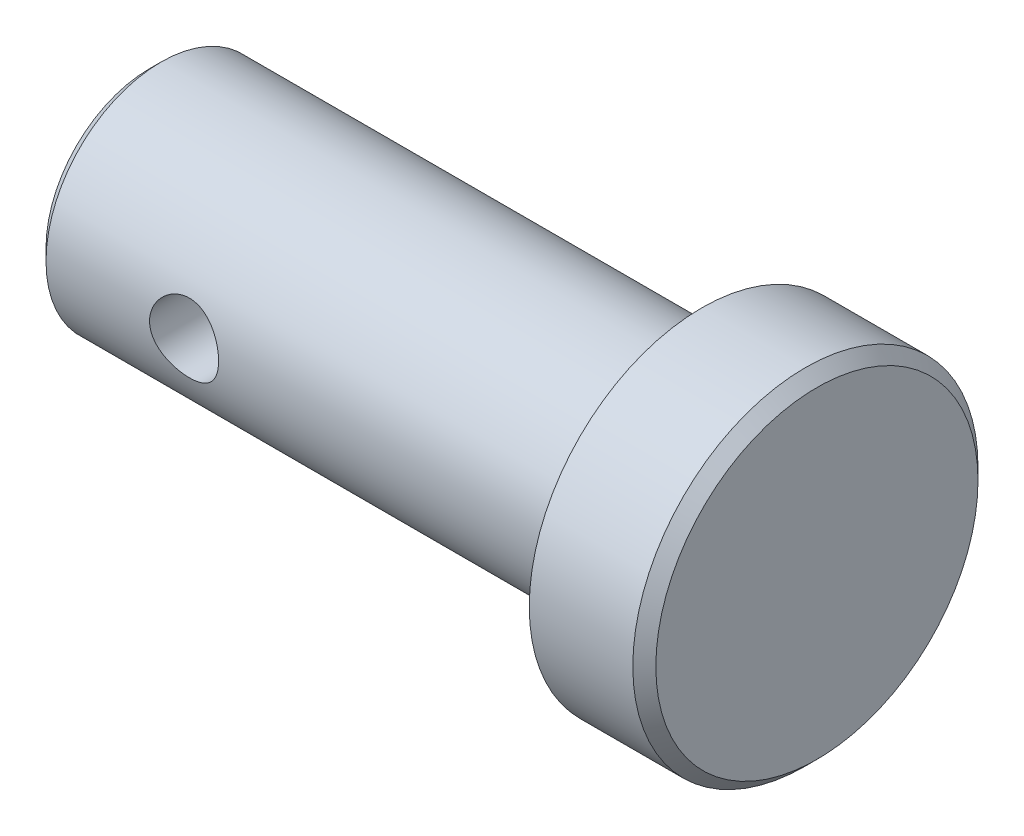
ISO-10303-21;
HEADER;
FILE_DESCRIPTION(('STEP AP214'),'2;1');
FILE_NAME('part.step','',(''),(''),'','','');
FILE_SCHEMA(('AUTOMOTIVE_DESIGN { 1 0 10303 214 1 1 1 1 }'));
ENDSEC;
DATA;
#1=APPLICATION_CONTEXT('core data for automotive mechanical design processes');
#2=APPLICATION_PROTOCOL_DEFINITION('international standard','automotive_design',2000,#1);
#3=PRODUCT_CONTEXT('',#1,'mechanical');
#4=PRODUCT('Part','Part','',(#3));
#5=PRODUCT_RELATED_PRODUCT_CATEGORY('part','',(#4));
#6=PRODUCT_DEFINITION_FORMATION('','',#4);
#7=PRODUCT_DEFINITION_CONTEXT('part definition',#1,'design');
#8=PRODUCT_DEFINITION('design','',#6,#7);
#9=PRODUCT_DEFINITION_SHAPE('','',#8);
#10=(LENGTH_UNIT() NAMED_UNIT(*) SI_UNIT(.MILLI.,.METRE.));
#11=(NAMED_UNIT(*) PLANE_ANGLE_UNIT() SI_UNIT($,.RADIAN.));
#12=(NAMED_UNIT(*) SI_UNIT($,.STERADIAN.) SOLID_ANGLE_UNIT());
#13=UNCERTAINTY_MEASURE_WITH_UNIT(LENGTH_MEASURE(1.E-05),#10,'distance_accuracy_value','');
#14=(GEOMETRIC_REPRESENTATION_CONTEXT(3) GLOBAL_UNCERTAINTY_ASSIGNED_CONTEXT((#13)) GLOBAL_UNIT_ASSIGNED_CONTEXT((#10,
#11,#12)) REPRESENTATION_CONTEXT('',''));
#15=CARTESIAN_POINT('',(0.,0.,0.));
#16=DIRECTION('',(0.,0.,1.));
#17=DIRECTION('',(1.,0.,0.));
#18=AXIS2_PLACEMENT_3D('',#15,#16,#17);
#19=CARTESIAN_POINT('',(12.,0.,0.));
#20=DIRECTION('',(-1.,0.,0.));
#21=DIRECTION('',(0.,0.,1.));
#22=AXIS2_PLACEMENT_3D('',#19,#20,#21);
#23=CYLINDRICAL_SURFACE('',#22,15.);
#24=CARTESIAN_POINT('',(11.,0.,0.));
#25=DIRECTION('',(1.,0.,0.));
#26=DIRECTION('',(0.,0.,-1.));
#27=AXIS2_PLACEMENT_3D('',#24,#25,#26);
#28=CIRCLE('',#27,15.);
#29=CARTESIAN_POINT('',(11.,0.,-15.));
#30=VERTEX_POINT('',#29);
#31=EDGE_CURVE('E10',#30,#30,#28,.F.);
#32=ORIENTED_EDGE('',*,*,#31,.T.);
#33=EDGE_LOOP('',(#32));
#34=FACE_BOUND('',#33,.T.);
#35=CARTESIAN_POINT('',(2.,0.,0.));
#36=DIRECTION('',(1.,0.,0.));
#37=DIRECTION('',(0.,0.,-1.));
#38=AXIS2_PLACEMENT_3D('',#35,#36,#37);
#39=CIRCLE('',#38,15.);
#40=CARTESIAN_POINT('',(2.,0.,-15.));
#41=VERTEX_POINT('',#40);
#42=EDGE_CURVE('E95',#41,#41,#39,.T.);
#43=ORIENTED_EDGE('',*,*,#42,.T.);
#44=EDGE_LOOP('',(#43));
#45=FACE_BOUND('',#44,.T.);
#46=ADVANCED_FACE('F31',(#34,#45),#23,.T.);
#47=CARTESIAN_POINT('',(12.,0.,0.));
#48=DIRECTION('',(1.,0.,0.));
#49=DIRECTION('',(0.,0.,-1.));
#50=AXIS2_PLACEMENT_3D('',#47,#48,#49);
#51=PLANE('',#50);
#52=CARTESIAN_POINT('',(12.,0.,0.));
#53=DIRECTION('',(1.,0.,0.));
#54=DIRECTION('',(0.,0.,-1.));
#55=AXIS2_PLACEMENT_3D('',#52,#53,#54);
#56=CIRCLE('',#55,14.);
#57=CARTESIAN_POINT('',(12.,0.,-14.));
#58=VERTEX_POINT('',#57);
#59=EDGE_CURVE('E43',#58,#58,#56,.T.);
#60=ORIENTED_EDGE('',*,*,#59,.T.);
#61=EDGE_LOOP('',(#60));
#62=FACE_BOUND('',#61,.T.);
#63=ADVANCED_FACE('F77',(#62),#51,.T.);
#64=CARTESIAN_POINT('',(2.,0.,0.));
#65=DIRECTION('',(1.,0.,0.));
#66=DIRECTION('',(0.,0.,-1.));
#67=AXIS2_PLACEMENT_3D('',#64,#65,#66);
#68=PLANE('',#67);
#69=CARTESIAN_POINT('',(2.,0.,0.));
#70=DIRECTION('',(1.,0.,0.));
#71=DIRECTION('',(0.,0.,-1.));
#72=AXIS2_PLACEMENT_3D('',#69,#70,#71);
#73=CIRCLE('',#72,10.);
#74=CARTESIAN_POINT('',(2.,0.,-10.));
#75=VERTEX_POINT('',#74);
#76=EDGE_CURVE('E92',#75,#75,#73,.F.);
#77=ORIENTED_EDGE('',*,*,#76,.F.);
#78=EDGE_LOOP('',(#77));
#79=FACE_BOUND('',#78,.T.);
#80=ORIENTED_EDGE('',*,*,#42,.F.);
#81=EDGE_LOOP('',(#80));
#82=FACE_BOUND('',#81,.T.);
#83=ADVANCED_FACE('F73',(#79,#82),#68,.F.);
#84=CARTESIAN_POINT('',(-46.,0.,0.));
#85=DIRECTION('',(1.,0.,0.));
#86=DIRECTION('',(0.,0.,-1.));
#87=AXIS2_PLACEMENT_3D('',#84,#85,#86);
#88=CYLINDRICAL_SURFACE('',#87,10.);
#89=CARTESIAN_POINT('',(-36.,0.,-10.));
#90=CARTESIAN_POINT('',(-35.9999980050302,-0.1645772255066,-9.99999858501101));
#91=CARTESIAN_POINT('',(-35.9864122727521,-0.329174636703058,-9.99589831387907));
#92=CARTESIAN_POINT('',(-35.9325572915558,-0.653576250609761,-9.97994211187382));
#93=CARTESIAN_POINT('',(-35.8922800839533,-0.813379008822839,-9.96808386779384));
#94=CARTESIAN_POINT('',(-35.7865079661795,-1.12346541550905,-9.93791105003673));
#95=CARTESIAN_POINT('',(-35.7210502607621,-1.27376272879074,-9.91960600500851));
#96=CARTESIAN_POINT('',(-35.5669278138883,-1.56124836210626,-9.87844218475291));
#97=CARTESIAN_POINT('',(-35.4782599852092,-1.69843493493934,-9.85558280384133));
#98=CARTESIAN_POINT('',(-35.2775519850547,-1.95974359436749,-9.80701474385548));
#99=CARTESIAN_POINT('',(-35.1649667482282,-2.08343614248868,-9.78124767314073));
#100=CARTESIAN_POINT('',(-34.9207815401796,-2.31049841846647,-9.73011668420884));
#101=CARTESIAN_POINT('',(-34.7891783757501,-2.41386472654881,-9.70475283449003));
#102=CARTESIAN_POINT('',(-34.5070584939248,-2.59960075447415,-9.65668227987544));
#103=CARTESIAN_POINT('',(-34.3561830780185,-2.68144618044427,-9.63404813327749));
#104=CARTESIAN_POINT('',(-34.0420214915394,-2.81842789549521,-9.59487240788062));
#105=CARTESIAN_POINT('',(-33.8787383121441,-2.87357059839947,-9.57832936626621));
#106=CARTESIAN_POINT('',(-33.5492194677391,-2.95403267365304,-9.55381741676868));
#107=CARTESIAN_POINT('',(-33.3831945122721,-2.98014392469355,-9.54562138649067));
#108=CARTESIAN_POINT('',(-33.0489336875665,-3.00427461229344,-9.53805579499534));
#109=CARTESIAN_POINT('',(-32.8806983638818,-3.00230085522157,-9.53868409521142));
#110=CARTESIAN_POINT('',(-32.553232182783,-2.97093954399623,-9.54849488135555));
#111=CARTESIAN_POINT('',(-32.3938954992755,-2.9425441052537,-9.55736777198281));
#112=CARTESIAN_POINT('',(-32.0823604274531,-2.86074840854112,-9.58216712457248));
#113=CARTESIAN_POINT('',(-31.9301627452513,-2.80734568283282,-9.59809428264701));
#114=CARTESIAN_POINT('',(-31.6347993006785,-2.67632053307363,-9.63545466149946));
#115=CARTESIAN_POINT('',(-31.4917858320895,-2.59837633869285,-9.65696032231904));
#116=CARTESIAN_POINT('',(-31.2205359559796,-2.42070445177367,-9.70301974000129));
#117=CARTESIAN_POINT('',(-31.0923031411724,-2.32097148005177,-9.72757423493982));
#118=CARTESIAN_POINT('',(-30.848627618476,-2.09762581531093,-9.77822022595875));
#119=CARTESIAN_POINT('',(-30.7339426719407,-1.97318981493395,-9.80433308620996));
#120=CARTESIAN_POINT('',(-30.5268920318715,-1.70652651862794,-9.85424488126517));
#121=CARTESIAN_POINT('',(-30.4345277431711,-1.56429810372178,-9.8780436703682));
#122=CARTESIAN_POINT('',(-30.2742801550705,-1.26471007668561,-9.92086320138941));
#123=CARTESIAN_POINT('',(-30.2065649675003,-1.1072554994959,-9.93985087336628));
#124=CARTESIAN_POINT('',(-30.0988008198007,-0.782490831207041,-9.97067043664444));
#125=CARTESIAN_POINT('',(-30.058744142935,-0.615183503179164,-9.98250432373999));
#126=CARTESIAN_POINT('',(-30.0086956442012,-0.281904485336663,-9.99736729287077));
#127=CARTESIAN_POINT('',(-29.9976768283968,-0.116100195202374,-10.0006970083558));
#128=CARTESIAN_POINT('',(-30.0031383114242,0.214999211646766,-9.99905846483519));
#129=CARTESIAN_POINT('',(-30.0196149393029,0.380294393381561,-9.99409131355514));
#130=CARTESIAN_POINT('',(-30.078769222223,0.701807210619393,-9.97661393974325));
#131=CARTESIAN_POINT('',(-30.1208467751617,0.858145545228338,-9.96427659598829));
#132=CARTESIAN_POINT('',(-30.2292864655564,1.16150927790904,-9.9334869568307));
#133=CARTESIAN_POINT('',(-30.2956515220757,1.30853355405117,-9.91503392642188));
#134=CARTESIAN_POINT('',(-30.4525063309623,1.5928743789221,-9.87339308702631));
#135=CARTESIAN_POINT('',(-30.543518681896,1.72988765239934,-9.8501056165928));
#136=CARTESIAN_POINT('',(-30.7464495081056,1.9870466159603,-9.80146937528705));
#137=CARTESIAN_POINT('',(-30.8583732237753,2.10718806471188,-9.7761200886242));
#138=CARTESIAN_POINT('',(-31.1047746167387,2.33171489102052,-9.72506343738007));
#139=CARTESIAN_POINT('',(-31.2399237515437,2.43536962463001,-9.69937650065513));
#140=CARTESIAN_POINT('',(-31.5262558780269,2.61857990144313,-9.65153030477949));
#141=CARTESIAN_POINT('',(-31.6774384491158,2.69813607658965,-9.62937095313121));
#142=CARTESIAN_POINT('',(-31.99106498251,2.83034694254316,-9.5913437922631));
#143=CARTESIAN_POINT('',(-32.1534523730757,2.88312693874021,-9.57544675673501));
#144=CARTESIAN_POINT('',(-32.4853759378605,2.96043461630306,-9.55183188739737));
#145=CARTESIAN_POINT('',(-32.6549096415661,2.98497197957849,-9.54411125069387));
#146=CARTESIAN_POINT('',(-32.9887230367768,3.0044396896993,-9.53799944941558));
#147=CARTESIAN_POINT('',(-33.1529273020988,3.00056110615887,-9.53923294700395));
#148=CARTESIAN_POINT('',(-33.4782282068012,2.96615010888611,-9.54998802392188));
#149=CARTESIAN_POINT('',(-33.639324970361,2.93561876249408,-9.55950927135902));
#150=CARTESIAN_POINT('',(-33.9518907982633,2.84953777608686,-9.58551527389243));
#151=CARTESIAN_POINT('',(-34.1034545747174,2.79430351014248,-9.60191209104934));
#152=CARTESIAN_POINT('',(-34.3952848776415,2.66063014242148,-9.63980557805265));
#153=CARTESIAN_POINT('',(-34.5355492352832,2.58218659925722,-9.6613032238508));
#154=CARTESIAN_POINT('',(-34.8063262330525,2.40097527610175,-9.70795352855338));
#155=CARTESIAN_POINT('',(-34.9362975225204,2.29742552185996,-9.7332108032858));
#156=CARTESIAN_POINT('',(-35.1774049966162,2.07034869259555,-9.78402640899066));
#157=CARTESIAN_POINT('',(-35.2885362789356,1.94681643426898,-9.80958481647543));
#158=CARTESIAN_POINT('',(-35.4920468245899,1.67893152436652,-9.85901873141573));
#159=CARTESIAN_POINT('',(-35.5837828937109,1.53407577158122,-9.88282319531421));
#160=CARTESIAN_POINT('',(-35.7414703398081,1.23028274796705,-9.92521360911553));
#161=CARTESIAN_POINT('',(-35.807433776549,1.07135210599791,-9.94380199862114));
#162=CARTESIAN_POINT('',(-35.9057905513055,0.761515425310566,-9.97204349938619));
#163=CARTESIAN_POINT('',(-35.9410233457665,0.611573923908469,-9.9824405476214));
#164=CARTESIAN_POINT('',(-35.9881270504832,0.307760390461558,-9.9964188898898));
#165=CARTESIAN_POINT('',(-36.0000018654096,0.153889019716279,-10.0000013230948));
#166=CARTESIAN_POINT('',(-36.,0.,-10.));
#167=B_SPLINE_CURVE_WITH_KNOTS('',3,(#89,#90,#91,#92,#93,#94,#95,#96,#97,#98,#99,#100,#101,#102,
#103,#104,#105,#106,#107,#108,#109,#110,#111,#112,#113,#114,#115,#116,#117,#118,#119,#120,#121,
#122,#123,#124,#125,#126,#127,#128,#129,#130,#131,#132,#133,#134,#135,#136,#137,#138,#139,#140,
#141,#142,#143,#144,#145,#146,#147,#148,#149,#150,#151,#152,#153,#154,#155,#156,#157,#158,#159,
#160,#161,#162,#163,#164,#165,#166),.UNSPECIFIED.,.T.,.F.,(4,2,2,2,2,2,2,2,2,2,2,2,2,2,2,2,2,2,
2,2,2,2,2,2,2,2,2,2,2,2,2,2,2,2,2,2,2,2,4),(0.,0.49316640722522,0.986479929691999,
1.47906735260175,1.9717203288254,2.47711205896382,2.98258874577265,3.49942962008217,
4.01614629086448,4.51839378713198,5.02051956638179,5.50452033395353,5.98856887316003,
6.4792485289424,6.97004720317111,7.48134208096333,7.99266913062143,8.50742093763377,
9.02202907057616,9.5181761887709,10.0142570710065,10.4991349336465,10.9840710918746,
11.4802261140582,11.9765056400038,12.4908080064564,13.0050968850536,13.516956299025,
14.0286401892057,14.5190031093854,15.0093463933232,15.4936008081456,15.9779479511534,
16.4799385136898,16.9820594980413,17.4988599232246,18.0154182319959,18.4766338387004,
18.9377723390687),.UNSPECIFIED.);
#168=CARTESIAN_POINT('',(-36.,0.,-10.));
#169=VERTEX_POINT('',#168);
#170=EDGE_CURVE('E35',#169,#169,#167,.T.);
#171=ORIENTED_EDGE('',*,*,#170,.T.);
#172=EDGE_LOOP('',(#171));
#173=FACE_BOUND('',#172,.T.);
#174=CARTESIAN_POINT('',(-30.,0.,10.));
#175=CARTESIAN_POINT('',(-30.0000019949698,-0.1645772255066,9.999998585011));
#176=CARTESIAN_POINT('',(-30.0135877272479,-0.329174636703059,9.99589831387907));
#177=CARTESIAN_POINT('',(-30.0674427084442,-0.653576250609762,9.97994211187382));
#178=CARTESIAN_POINT('',(-30.1077199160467,-0.813379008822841,9.96808386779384));
#179=CARTESIAN_POINT('',(-30.2134920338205,-1.12346541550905,9.93791105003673));
#180=CARTESIAN_POINT('',(-30.2789497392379,-1.27376272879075,9.91960600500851));
#181=CARTESIAN_POINT('',(-30.4330721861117,-1.56124836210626,9.8784421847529));
#182=CARTESIAN_POINT('',(-30.5217400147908,-1.69843493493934,9.85558280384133));
#183=CARTESIAN_POINT('',(-30.7224480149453,-1.95974359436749,9.80701474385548));
#184=CARTESIAN_POINT('',(-30.8350332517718,-2.08343614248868,9.78124767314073));
#185=CARTESIAN_POINT('',(-31.0792184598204,-2.31049841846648,9.73011668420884));
#186=CARTESIAN_POINT('',(-31.2108216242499,-2.41386472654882,9.70475283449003));
#187=CARTESIAN_POINT('',(-31.4929415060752,-2.59960075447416,9.65668227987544));
#188=CARTESIAN_POINT('',(-31.6438169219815,-2.68144618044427,9.63404813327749));
#189=CARTESIAN_POINT('',(-31.9579785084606,-2.81842789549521,9.59487240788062));
#190=CARTESIAN_POINT('',(-32.1212616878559,-2.87357059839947,9.57832936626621));
#191=CARTESIAN_POINT('',(-32.4507805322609,-2.95403267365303,9.55381741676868));
#192=CARTESIAN_POINT('',(-32.6168054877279,-2.98014392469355,9.54562138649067));
#193=CARTESIAN_POINT('',(-32.9510663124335,-3.00427461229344,9.53805579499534));
#194=CARTESIAN_POINT('',(-33.1193016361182,-3.00230085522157,9.53868409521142));
#195=CARTESIAN_POINT('',(-33.446767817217,-2.97093954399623,9.54849488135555));
#196=CARTESIAN_POINT('',(-33.6061045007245,-2.9425441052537,9.55736777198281));
#197=CARTESIAN_POINT('',(-33.9176395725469,-2.86074840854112,9.58216712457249));
#198=CARTESIAN_POINT('',(-34.0698372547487,-2.80734568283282,9.59809428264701));
#199=CARTESIAN_POINT('',(-34.3652006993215,-2.67632053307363,9.63545466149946));
#200=CARTESIAN_POINT('',(-34.5082141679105,-2.59837633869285,9.65696032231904));
#201=CARTESIAN_POINT('',(-34.7794640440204,-2.42070445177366,9.70301974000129));
#202=CARTESIAN_POINT('',(-34.9076968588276,-2.32097148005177,9.72757423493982));
#203=CARTESIAN_POINT('',(-35.151372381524,-2.09762581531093,9.77822022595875));
#204=CARTESIAN_POINT('',(-35.2660573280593,-1.97318981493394,9.80433308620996));
#205=CARTESIAN_POINT('',(-35.4731079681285,-1.70652651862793,9.85424488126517));
#206=CARTESIAN_POINT('',(-35.5654722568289,-1.56429810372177,9.8780436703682));
#207=CARTESIAN_POINT('',(-35.7257198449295,-1.2647100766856,9.92086320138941));
#208=CARTESIAN_POINT('',(-35.7934350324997,-1.1072554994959,9.93985087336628));
#209=CARTESIAN_POINT('',(-35.9011991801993,-0.782490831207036,9.97067043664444));
#210=CARTESIAN_POINT('',(-35.941255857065,-0.615183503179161,9.98250432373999));
#211=CARTESIAN_POINT('',(-35.9913043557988,-0.281904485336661,9.99736729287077));
#212=CARTESIAN_POINT('',(-36.0023231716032,-0.116100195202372,10.0006970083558));
#213=CARTESIAN_POINT('',(-35.9968616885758,0.214999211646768,9.99905846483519));
#214=CARTESIAN_POINT('',(-35.9803850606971,0.380294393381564,9.99409131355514));
#215=CARTESIAN_POINT('',(-35.921230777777,0.701807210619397,9.97661393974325));
#216=CARTESIAN_POINT('',(-35.8791532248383,0.858145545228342,9.96427659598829));
#217=CARTESIAN_POINT('',(-35.7707135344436,1.16150927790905,9.9334869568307));
#218=CARTESIAN_POINT('',(-35.7043484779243,1.30853355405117,9.91503392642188));
#219=CARTESIAN_POINT('',(-35.5474936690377,1.59287437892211,9.87339308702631));
#220=CARTESIAN_POINT('',(-35.456481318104,1.72988765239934,9.8501056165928));
#221=CARTESIAN_POINT('',(-35.2535504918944,1.9870466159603,9.80146937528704));
#222=CARTESIAN_POINT('',(-35.1416267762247,2.10718806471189,9.77612008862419));
#223=CARTESIAN_POINT('',(-34.8952253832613,2.33171489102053,9.72506343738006));
#224=CARTESIAN_POINT('',(-34.7600762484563,2.43536962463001,9.69937650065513));
#225=CARTESIAN_POINT('',(-34.4737441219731,2.61857990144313,9.65153030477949));
#226=CARTESIAN_POINT('',(-34.3225615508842,2.69813607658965,9.62937095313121));
#227=CARTESIAN_POINT('',(-34.00893501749,2.83034694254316,9.5913437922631));
#228=CARTESIAN_POINT('',(-33.8465476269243,2.88312693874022,9.57544675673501));
#229=CARTESIAN_POINT('',(-33.5146240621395,2.96043461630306,9.55183188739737));
#230=CARTESIAN_POINT('',(-33.3450903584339,2.98497197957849,9.54411125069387));
#231=CARTESIAN_POINT('',(-33.0112769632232,3.0044396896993,9.53799944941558));
#232=CARTESIAN_POINT('',(-32.8470726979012,3.00056110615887,9.53923294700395));
#233=CARTESIAN_POINT('',(-32.5217717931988,2.9661501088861,9.54998802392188));
#234=CARTESIAN_POINT('',(-32.360675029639,2.93561876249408,9.55950927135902));
#235=CARTESIAN_POINT('',(-32.0481092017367,2.84953777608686,9.58551527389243));
#236=CARTESIAN_POINT('',(-31.8965454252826,2.79430351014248,9.60191209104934));
#237=CARTESIAN_POINT('',(-31.6047151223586,2.66063014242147,9.63980557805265));
#238=CARTESIAN_POINT('',(-31.4644507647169,2.58218659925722,9.6613032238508));
#239=CARTESIAN_POINT('',(-31.1936737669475,2.40097527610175,9.70795352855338));
#240=CARTESIAN_POINT('',(-31.0637024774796,2.29742552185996,9.7332108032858));
#241=CARTESIAN_POINT('',(-30.8225950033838,2.07034869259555,9.78402640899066));
#242=CARTESIAN_POINT('',(-30.7114637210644,1.94681643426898,9.80958481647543));
#243=CARTESIAN_POINT('',(-30.5079531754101,1.67893152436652,9.85901873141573));
#244=CARTESIAN_POINT('',(-30.4162171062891,1.53407577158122,9.88282319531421));
#245=CARTESIAN_POINT('',(-30.2585296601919,1.23028274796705,9.92521360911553));
#246=CARTESIAN_POINT('',(-30.192566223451,1.07135210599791,9.94380199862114));
#247=CARTESIAN_POINT('',(-30.0942094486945,0.761515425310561,9.97204349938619));
#248=CARTESIAN_POINT('',(-30.0589766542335,0.611573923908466,9.9824405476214));
#249=CARTESIAN_POINT('',(-30.0118729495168,0.307760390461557,9.9964188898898));
#250=CARTESIAN_POINT('',(-29.9999981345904,0.153889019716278,10.0000013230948));
#251=CARTESIAN_POINT('',(-30.,0.,10.));
#252=B_SPLINE_CURVE_WITH_KNOTS('',3,(#174,#175,#176,#177,#178,#179,#180,#181,#182,#183,#184,
#185,#186,#187,#188,#189,#190,#191,#192,#193,#194,#195,#196,#197,#198,#199,#200,#201,#202,#203,
#204,#205,#206,#207,#208,#209,#210,#211,#212,#213,#214,#215,#216,#217,#218,#219,#220,#221,#222,
#223,#224,#225,#226,#227,#228,#229,#230,#231,#232,#233,#234,#235,#236,#237,#238,#239,#240,#241,
#242,#243,#244,#245,#246,#247,#248,#249,#250,#251),.UNSPECIFIED.,.T.,.F.,(4,2,2,2,2,2,2,2,2,2,2,
2,2,2,2,2,2,2,2,2,2,2,2,2,2,2,2,2,2,2,2,2,2,2,2,2,2,2,4),(0.,0.493166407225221,0.986479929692,
1.47906735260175,1.9717203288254,2.47711205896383,2.98258874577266,3.49942962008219,
4.01614629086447,4.51839378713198,5.02051956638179,5.50452033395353,5.98856887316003,
6.4792485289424,6.97004720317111,7.48134208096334,7.99266913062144,8.50742093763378,
9.02202907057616,9.5181761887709,10.0142570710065,10.4991349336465,10.9840710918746,
11.4802261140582,11.9765056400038,12.4908080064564,13.0050968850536,13.516956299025,
14.0286401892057,14.5190031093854,15.0093463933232,15.4936008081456,15.9779479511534,
16.4799385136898,16.9820594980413,17.4988599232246,18.0154182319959,18.4766338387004,
18.9377723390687),.UNSPECIFIED.);
#253=CARTESIAN_POINT('',(-30.,0.,10.));
#254=VERTEX_POINT('',#253);
#255=EDGE_CURVE('E51',#254,#254,#252,.T.);
#256=ORIENTED_EDGE('',*,*,#255,.T.);
#257=EDGE_LOOP('',(#256));
#258=FACE_BOUND('',#257,.T.);
#259=CARTESIAN_POINT('',(-45.,0.,0.));
#260=DIRECTION('',(-1.,0.,0.));
#261=DIRECTION('',(0.,0.,1.));
#262=AXIS2_PLACEMENT_3D('',#259,#260,#261);
#263=CIRCLE('',#262,10.);
#264=CARTESIAN_POINT('',(-45.,0.,10.));
#265=VERTEX_POINT('',#264);
#266=EDGE_CURVE('E48',#265,#265,#263,.F.);
#267=ORIENTED_EDGE('',*,*,#266,.T.);
#268=EDGE_LOOP('',(#267));
#269=FACE_BOUND('',#268,.T.);
#270=ORIENTED_EDGE('',*,*,#76,.T.);
#271=EDGE_LOOP('',(#270));
#272=FACE_BOUND('',#271,.T.);
#273=ADVANCED_FACE('F55',(#173,#258,#269,#272),#88,.T.);
#274=CARTESIAN_POINT('',(-46.,0.,0.));
#275=DIRECTION('',(-1.,0.,0.));
#276=DIRECTION('',(0.,0.,1.));
#277=AXIS2_PLACEMENT_3D('',#274,#275,#276);
#278=PLANE('',#277);
#279=CARTESIAN_POINT('',(-46.,0.,0.));
#280=DIRECTION('',(-1.,0.,0.));
#281=DIRECTION('',(0.,0.,1.));
#282=AXIS2_PLACEMENT_3D('',#279,#280,#281);
#283=CIRCLE('',#282,8.99999999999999);
#284=CARTESIAN_POINT('',(-46.,0.,8.99999999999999));
#285=VERTEX_POINT('',#284);
#286=EDGE_CURVE('E97',#285,#285,#283,.T.);
#287=ORIENTED_EDGE('',*,*,#286,.T.);
#288=EDGE_LOOP('',(#287));
#289=FACE_BOUND('',#288,.T.);
#290=ADVANCED_FACE('F63',(#289),#278,.T.);
#291=CARTESIAN_POINT('',(-46.,0.,0.));
#292=DIRECTION('',(1.,0.,0.));
#293=DIRECTION('',(0.,0.,-1.));
#294=AXIS2_PLACEMENT_3D('',#291,#292,#293);
#295=CONICAL_SURFACE('',#294,8.99999999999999,0.785398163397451);
#296=ORIENTED_EDGE('',*,*,#266,.F.);
#297=EDGE_LOOP('',(#296));
#298=FACE_BOUND('',#297,.T.);
#299=ORIENTED_EDGE('',*,*,#286,.F.);
#300=EDGE_LOOP('',(#299));
#301=FACE_BOUND('',#300,.T.);
#302=ADVANCED_FACE('F66',(#298,#301),#295,.T.);
#303=CARTESIAN_POINT('',(12.,0.,0.));
#304=DIRECTION('',(-1.,0.,0.));
#305=DIRECTION('',(0.,0.,1.));
#306=AXIS2_PLACEMENT_3D('',#303,#304,#305);
#307=CONICAL_SURFACE('',#306,14.,0.785398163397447);
#308=ORIENTED_EDGE('',*,*,#31,.F.);
#309=EDGE_LOOP('',(#308));
#310=FACE_BOUND('',#309,.T.);
#311=ORIENTED_EDGE('',*,*,#59,.F.);
#312=EDGE_LOOP('',(#311));
#313=FACE_BOUND('',#312,.T.);
#314=ADVANCED_FACE('F33',(#310,#313),#307,.T.);
#315=CARTESIAN_POINT('',(-33.,0.,-24.));
#316=DIRECTION('',(0.,0.,1.));
#317=DIRECTION('',(1.,0.,0.));
#318=AXIS2_PLACEMENT_3D('',#315,#316,#317);
#319=CYLINDRICAL_SURFACE('',#318,3.);
#320=ORIENTED_EDGE('',*,*,#255,.F.);
#321=EDGE_LOOP('',(#320));
#322=FACE_BOUND('',#321,.T.);
#323=ORIENTED_EDGE('',*,*,#170,.F.);
#324=EDGE_LOOP('',(#323));
#325=FACE_BOUND('',#324,.T.);
#326=ADVANCED_FACE('F59',(#322,#325),#319,.F.);
#327=CLOSED_SHELL('',(#46,#63,#83,#273,#290,#302,#314,#326));
#328=MANIFOLD_SOLID_BREP('B2',#327);
#329=ADVANCED_BREP_SHAPE_REPRESENTATION('',(#18,#328),#14);
#330=SHAPE_DEFINITION_REPRESENTATION(#9,#329);
ENDSEC;
END-ISO-10303-21;
